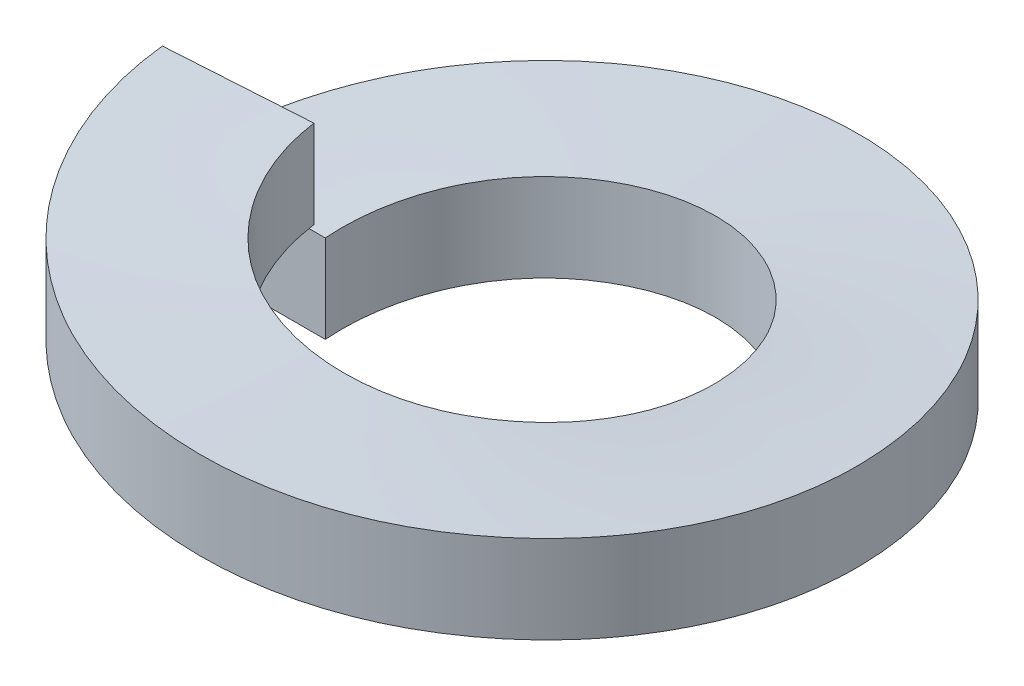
ISO-10303-21;
HEADER;
FILE_DESCRIPTION(('STEP AP214'),'2;1');
FILE_NAME('part.step','',(''),(''),'','','');
FILE_SCHEMA(('AUTOMOTIVE_DESIGN { 1 0 10303 214 1 1 1 1 }'));
ENDSEC;
DATA;
#1=APPLICATION_CONTEXT('core data for automotive mechanical design processes');
#2=APPLICATION_PROTOCOL_DEFINITION('international standard','automotive_design',2000,#1);
#3=PRODUCT_CONTEXT('',#1,'mechanical');
#4=PRODUCT('Part','Part','',(#3));
#5=PRODUCT_RELATED_PRODUCT_CATEGORY('part','',(#4));
#6=PRODUCT_DEFINITION_FORMATION('','',#4);
#7=PRODUCT_DEFINITION_CONTEXT('part definition',#1,'design');
#8=PRODUCT_DEFINITION('design','',#6,#7);
#9=PRODUCT_DEFINITION_SHAPE('','',#8);
#10=(LENGTH_UNIT() NAMED_UNIT(*) SI_UNIT(.MILLI.,.METRE.));
#11=(NAMED_UNIT(*) PLANE_ANGLE_UNIT() SI_UNIT($,.RADIAN.));
#12=(NAMED_UNIT(*) SI_UNIT($,.STERADIAN.) SOLID_ANGLE_UNIT());
#13=UNCERTAINTY_MEASURE_WITH_UNIT(LENGTH_MEASURE(1.E-05),#10,'distance_accuracy_value','');
#14=(GEOMETRIC_REPRESENTATION_CONTEXT(3) GLOBAL_UNCERTAINTY_ASSIGNED_CONTEXT((#13)) GLOBAL_UNIT_ASSIGNED_CONTEXT((#10,
#11,#12)) REPRESENTATION_CONTEXT('',''));
#15=CARTESIAN_POINT('',(0.,0.,0.));
#16=DIRECTION('',(0.,0.,1.));
#17=DIRECTION('',(1.,0.,0.));
#18=AXIS2_PLACEMENT_3D('',#15,#16,#17);
#19=CARTESIAN_POINT('',(-3.81,0.,0.));
#20=DIRECTION('',(0.,0.,1.));
#21=DIRECTION('',(1.,0.,0.));
#22=AXIS2_PLACEMENT_3D('',#19,#20,#21);
#23=PLANE('',#22);
#24=DIRECTION('',(0.,-1.,0.));
#25=VECTOR('',#24,1.);
#26=CARTESIAN_POINT('',(-3.81,1.016,0.));
#27=LINE('',#26,#25);
#28=CARTESIAN_POINT('',(-3.81,1.016,0.));
#29=VERTEX_POINT('',#28);
#30=CARTESIAN_POINT('',(-3.81,0.,0.));
#31=VERTEX_POINT('',#30);
#32=EDGE_CURVE('E87',#29,#31,#27,.T.);
#33=ORIENTED_EDGE('',*,*,#32,.T.);
#34=DIRECTION('',(1.,0.,0.));
#35=VECTOR('',#34,1.);
#36=CARTESIAN_POINT('',(-3.81,0.,0.));
#37=LINE('',#36,#35);
#38=CARTESIAN_POINT('',(-2.159,0.,0.));
#39=VERTEX_POINT('',#38);
#40=EDGE_CURVE('E80',#31,#39,#37,.T.);
#41=ORIENTED_EDGE('',*,*,#40,.T.);
#42=DIRECTION('',(0.,1.,0.));
#43=VECTOR('',#42,1.);
#44=CARTESIAN_POINT('',(-2.159,1.016,0.));
#45=LINE('',#44,#43);
#46=CARTESIAN_POINT('',(-2.159,1.016,0.));
#47=VERTEX_POINT('',#46);
#48=EDGE_CURVE('E75',#39,#47,#45,.T.);
#49=ORIENTED_EDGE('',*,*,#48,.T.);
#50=DIRECTION('',(-1.,0.,0.));
#51=VECTOR('',#50,1.);
#52=CARTESIAN_POINT('',(-3.81,1.016,0.));
#53=LINE('',#52,#51);
#54=EDGE_CURVE('E70',#47,#29,#53,.T.);
#55=ORIENTED_EDGE('',*,*,#54,.T.);
#56=EDGE_LOOP('',(#33,#41,#49,#55));
#57=FACE_BOUND('',#56,.T.);
#58=ADVANCED_FACE('F35',(#57),#23,.T.);
#59=CARTESIAN_POINT('',(-3.80248183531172,1.2192,0.239231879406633));
#60=DIRECTION('',(0.0627905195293,0.,0.998026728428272));
#61=DIRECTION('',(0.998026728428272,0.,-0.0627905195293));
#62=AXIS2_PLACEMENT_3D('',#59,#60,#61);
#63=PLANE('',#62);
#64=DIRECTION('',(0.,-1.,0.));
#65=VECTOR('',#64,1.);
#66=CARTESIAN_POINT('',(-3.80248183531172,2.2352,0.239231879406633));
#67=LINE('',#66,#65);
#68=CARTESIAN_POINT('',(-3.80248183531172,2.2352,0.239231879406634));
#69=VERTEX_POINT('',#68);
#70=CARTESIAN_POINT('',(-3.80248183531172,1.2192,0.239231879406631));
#71=VERTEX_POINT('',#70);
#72=EDGE_CURVE('E95',#69,#71,#67,.T.);
#73=ORIENTED_EDGE('',*,*,#72,.F.);
#74=DIRECTION('',(-0.998026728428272,0.,0.0627905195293));
#75=VECTOR('',#74,1.);
#76=CARTESIAN_POINT('',(-3.80248183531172,2.2352,0.239231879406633));
#77=LINE('',#76,#75);
#78=CARTESIAN_POINT('',(-2.15473970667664,2.2352,0.13556473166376));
#79=VERTEX_POINT('',#78);
#80=EDGE_CURVE('E11',#79,#69,#77,.T.);
#81=ORIENTED_EDGE('',*,*,#80,.F.);
#82=DIRECTION('',(0.,1.,0.));
#83=VECTOR('',#82,1.);
#84=CARTESIAN_POINT('',(-2.15473970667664,2.2352,0.135564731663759));
#85=LINE('',#84,#83);
#86=CARTESIAN_POINT('',(-2.15473970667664,1.2192,0.135564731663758));
#87=VERTEX_POINT('',#86);
#88=EDGE_CURVE('E49',#87,#79,#85,.T.);
#89=ORIENTED_EDGE('',*,*,#88,.F.);
#90=DIRECTION('',(0.998026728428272,0.,-0.0627905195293));
#91=VECTOR('',#90,1.);
#92=CARTESIAN_POINT('',(-3.80248183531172,1.2192,0.239231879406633));
#93=LINE('',#92,#91);
#94=EDGE_CURVE('E58',#71,#87,#93,.T.);
#95=ORIENTED_EDGE('',*,*,#94,.F.);
#96=EDGE_LOOP('',(#73,#81,#89,#95));
#97=FACE_BOUND('',#96,.T.);
#98=ADVANCED_FACE('F141',(#97),#63,.F.);
#99=CARTESIAN_POINT('',(0.,0.,0.));
#100=DIRECTION('',(0.,1.,0.));
#101=DIRECTION('',(0.,0.,1.));
#102=AXIS2_PLACEMENT_3D('',#99,#100,#101);
#103=CYLINDRICAL_SURFACE('',#102,3.81);
#104=CARTESIAN_POINT('',(-3.81,0.,0.));
#105=CARTESIAN_POINT('',(-3.81,0.1016,-2.17318563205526));
#106=CARTESIAN_POINT('',(-1.93944779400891,0.2032,-3.27942712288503));
#107=CARTESIAN_POINT('',(-0.0688955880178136,0.3048,-4.3856686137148));
#108=CARTESIAN_POINT('',(1.83548149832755,0.4064,-3.33872845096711));
#109=CARTESIAN_POINT('',(3.73985858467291,0.508,-2.29178828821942));
#110=CARTESIAN_POINT('',(3.80811999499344,0.6096,-0.119674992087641));
#111=CARTESIAN_POINT('',(3.87638140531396,0.7112,2.05243830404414));
#112=CARTESIAN_POINT('',(2.04150008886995,0.8128,3.2168893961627));
#113=CARTESIAN_POINT('',(0.206618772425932,0.9144,4.38134048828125));
#114=CARTESIAN_POINT('',(-1.72970380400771,1.016,3.39473485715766));
#115=CARTESIAN_POINT('',(-3.66602638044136,1.1176,2.40812922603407));
#116=CARTESIAN_POINT('',(-3.80248183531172,1.2192,0.239231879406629));
#117=(BOUNDED_CURVE() B_SPLINE_CURVE(2,(#104,#105,#106,#107,#108,#109,#110,#111,#112,#113,#114,
#115,#116),.UNSPECIFIED.,.F.,.F.) B_SPLINE_CURVE_WITH_KNOTS((3,2,2,2,2,2,3),(0.,
0.166666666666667,0.333333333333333,0.5,0.666666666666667,0.833333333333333,1.),
.UNSPECIFIED.) CURVE() GEOMETRIC_REPRESENTATION_ITEM() RATIONAL_B_SPLINE_CURVE((1.,
0.868631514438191,1.,0.868631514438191,1.,0.868631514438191,1.,0.868631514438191,1.,
0.868631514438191,1.,0.868631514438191,1.)) REPRESENTATION_ITEM(''));
#118=EDGE_CURVE('E90',#31,#71,#117,.T.);
#119=ORIENTED_EDGE('',*,*,#118,.F.);
#120=ORIENTED_EDGE('',*,*,#32,.F.);
#121=CARTESIAN_POINT('',(-3.81,1.016,0.));
#122=CARTESIAN_POINT('',(-3.81,1.1176,-2.17318563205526));
#123=CARTESIAN_POINT('',(-1.93944779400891,1.2192,-3.27942712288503));
#124=CARTESIAN_POINT('',(-0.0688955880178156,1.3208,-4.3856686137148));
#125=CARTESIAN_POINT('',(1.83548149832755,1.4224,-3.33872845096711));
#126=CARTESIAN_POINT('',(3.73985858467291,1.524,-2.29178828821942));
#127=CARTESIAN_POINT('',(3.80811999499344,1.6256,-0.119674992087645));
#128=CARTESIAN_POINT('',(3.87638140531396,1.7272,2.05243830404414));
#129=CARTESIAN_POINT('',(2.04150008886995,1.8288,3.21688939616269));
#130=CARTESIAN_POINT('',(0.206618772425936,1.9304,4.38134048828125));
#131=CARTESIAN_POINT('',(-1.72970380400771,2.032,3.39473485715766));
#132=CARTESIAN_POINT('',(-3.66602638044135,2.1336,2.40812922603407));
#133=CARTESIAN_POINT('',(-3.80248183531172,2.2352,0.239231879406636));
#134=(BOUNDED_CURVE() B_SPLINE_CURVE(2,(#121,#122,#123,#124,#125,#126,#127,#128,#129,#130,#131,
#132,#133),.UNSPECIFIED.,.F.,.F.) B_SPLINE_CURVE_WITH_KNOTS((3,2,2,2,2,2,3),(0.,
0.166666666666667,0.333333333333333,0.5,0.666666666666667,0.833333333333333,1.),
.UNSPECIFIED.) CURVE() GEOMETRIC_REPRESENTATION_ITEM() RATIONAL_B_SPLINE_CURVE((1.,
0.868631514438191,1.,0.868631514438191,1.,0.868631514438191,1.,0.868631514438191,1.,
0.868631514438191,1.,0.868631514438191,1.)) REPRESENTATION_ITEM(''));
#135=EDGE_CURVE('E89',#29,#69,#134,.T.);
#136=ORIENTED_EDGE('',*,*,#135,.T.);
#137=ORIENTED_EDGE('',*,*,#72,.T.);
#138=EDGE_LOOP('',(#119,#120,#136,#137));
#139=FACE_BOUND('',#138,.T.);
#140=ADVANCED_FACE('F88',(#139),#103,.T.);
#141=CARTESIAN_POINT('',(-3.81,0.,0.));
#142=CARTESIAN_POINT('',(-3.81,0.1016,-2.17318563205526));
#143=CARTESIAN_POINT('',(-1.93944779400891,0.2032,-3.27942712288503));
#144=CARTESIAN_POINT('',(-0.0688955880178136,0.3048,-4.3856686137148));
#145=CARTESIAN_POINT('',(1.83548149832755,0.4064,-3.33872845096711));
#146=CARTESIAN_POINT('',(3.73985858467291,0.508,-2.29178828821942));
#147=CARTESIAN_POINT('',(3.80811999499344,0.6096,-0.119674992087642));
#148=CARTESIAN_POINT('',(3.87638140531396,0.7112,2.05243830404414));
#149=CARTESIAN_POINT('',(2.04150008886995,0.8128,3.2168893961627));
#150=CARTESIAN_POINT('',(0.206618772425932,0.9144,4.38134048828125));
#151=CARTESIAN_POINT('',(-1.72970380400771,1.016,3.39473485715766));
#152=CARTESIAN_POINT('',(-3.66602638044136,1.1176,2.40812922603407));
#153=CARTESIAN_POINT('',(-3.80248183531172,1.2192,0.239231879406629));
#154=CARTESIAN_POINT('',(-2.159,0.,0.));
#155=CARTESIAN_POINT('',(-2.159,0.1016,-1.23147185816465));
#156=CARTESIAN_POINT('',(-1.09902041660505,0.2032,-1.85834203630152));
#157=CARTESIAN_POINT('',(-0.0390408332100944,0.3048,-2.48521221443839));
#158=CARTESIAN_POINT('',(1.04010618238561,0.4064,-1.8919461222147));
#159=CARTESIAN_POINT('',(2.11925319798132,0.508,-1.29868002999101));
#160=CARTESIAN_POINT('',(2.15793466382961,0.6096,-0.0678158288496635));
#161=CARTESIAN_POINT('',(2.19661612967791,0.7112,1.16304837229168));
#162=CARTESIAN_POINT('',(1.15685005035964,0.8128,1.82290399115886));
#163=CARTESIAN_POINT('',(0.117083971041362,0.9144,2.48275961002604));
#164=CARTESIAN_POINT('',(-0.980165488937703,1.016,1.92368308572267));
#165=CARTESIAN_POINT('',(-2.07741494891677,1.1176,1.36460656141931));
#166=CARTESIAN_POINT('',(-2.15473970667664,1.2192,0.135564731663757));
#167=(BOUNDED_SURFACE() B_SPLINE_SURFACE(1,2,((#141,#142,#143,#144,#145,#146,#147,#148,#149,
#150,#151,#152,#153),(#154,#155,#156,#157,#158,#159,#160,#161,#162,#163,#164,#165,#166)),
.UNSPECIFIED.,.F.,.F.,.F.) B_SPLINE_SURFACE_WITH_KNOTS((2,2),(3,2,2,2,2,2,3),(0.,1.),(0.,
0.166666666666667,0.333333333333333,0.5,0.666666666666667,0.833333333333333,1.),
.UNSPECIFIED.) GEOMETRIC_REPRESENTATION_ITEM() RATIONAL_B_SPLINE_SURFACE(((1.,0.868631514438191,
1.,0.868631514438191,1.,0.868631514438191,1.,0.868631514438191,1.,0.868631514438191,1.,
0.868631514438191,1.),(1.,0.868631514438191,1.,0.868631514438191,1.,0.868631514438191,1.,
0.868631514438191,1.,0.868631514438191,1.,0.868631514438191,1.))) REPRESENTATION_ITEM('') SURFACE());
#168=CARTESIAN_POINT('',(-2.159,0.,0.));
#169=CARTESIAN_POINT('',(-2.159,0.1016,-1.23147185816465));
#170=CARTESIAN_POINT('',(-1.09902041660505,0.2032,-1.85834203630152));
#171=CARTESIAN_POINT('',(-0.0390408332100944,0.3048,-2.48521221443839));
#172=CARTESIAN_POINT('',(1.04010618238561,0.4064,-1.8919461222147));
#173=CARTESIAN_POINT('',(2.11925319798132,0.508,-1.29868002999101));
#174=CARTESIAN_POINT('',(2.15793466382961,0.6096,-0.0678158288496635));
#175=CARTESIAN_POINT('',(2.19661612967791,0.7112,1.16304837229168));
#176=CARTESIAN_POINT('',(1.15685005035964,0.8128,1.82290399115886));
#177=CARTESIAN_POINT('',(0.117083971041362,0.9144,2.48275961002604));
#178=CARTESIAN_POINT('',(-0.980165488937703,1.016,1.92368308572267));
#179=CARTESIAN_POINT('',(-2.07741494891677,1.1176,1.36460656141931));
#180=CARTESIAN_POINT('',(-2.15473970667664,1.2192,0.135564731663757));
#181=(BOUNDED_CURVE() B_SPLINE_CURVE(2,(#168,#169,#170,#171,#172,#173,#174,#175,#176,#177,#178,
#179,#180),.UNSPECIFIED.,.F.,.F.) B_SPLINE_CURVE_WITH_KNOTS((3,2,2,2,2,2,3),(0.,
0.166666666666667,0.333333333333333,0.5,0.666666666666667,0.833333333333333,1.),
.UNSPECIFIED.) CURVE() GEOMETRIC_REPRESENTATION_ITEM() RATIONAL_B_SPLINE_CURVE((1.,
0.868631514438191,1.,0.868631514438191,1.,0.868631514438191,1.,0.868631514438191,1.,
0.868631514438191,1.,0.868631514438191,1.)) REPRESENTATION_ITEM(''));
#182=EDGE_CURVE('E110',#39,#87,#181,.T.);
#183=ORIENTED_EDGE('',*,*,#182,.F.);
#184=ORIENTED_EDGE('',*,*,#40,.F.);
#185=ORIENTED_EDGE('',*,*,#118,.T.);
#186=ORIENTED_EDGE('',*,*,#94,.T.);
#187=EDGE_LOOP('',(#183,#184,#185,#186));
#188=FACE_BOUND('',#187,.T.);
#189=ADVANCED_FACE('F128',(#188),#167,.F.);
#190=CARTESIAN_POINT('',(0.,0.,0.));
#191=DIRECTION('',(0.,1.,0.));
#192=DIRECTION('',(0.,0.,1.));
#193=AXIS2_PLACEMENT_3D('',#190,#191,#192);
#194=CYLINDRICAL_SURFACE('',#193,2.159);
#195=CARTESIAN_POINT('',(-2.159,1.016,0.));
#196=CARTESIAN_POINT('',(-2.159,1.1176,-1.23147185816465));
#197=CARTESIAN_POINT('',(-1.09902041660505,1.2192,-1.85834203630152));
#198=CARTESIAN_POINT('',(-0.0390408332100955,1.3208,-2.48521221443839));
#199=CARTESIAN_POINT('',(1.04010618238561,1.4224,-1.8919461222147));
#200=CARTESIAN_POINT('',(2.11925319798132,1.524,-1.29868002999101));
#201=CARTESIAN_POINT('',(2.15793466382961,1.6256,-0.0678158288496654));
#202=CARTESIAN_POINT('',(2.19661612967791,1.7272,1.16304837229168));
#203=CARTESIAN_POINT('',(1.15685005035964,1.8288,1.82290399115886));
#204=CARTESIAN_POINT('',(0.117083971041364,1.9304,2.48275961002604));
#205=CARTESIAN_POINT('',(-0.980165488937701,2.032,1.92368308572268));
#206=CARTESIAN_POINT('',(-2.07741494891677,2.1336,1.36460656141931));
#207=CARTESIAN_POINT('',(-2.15473970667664,2.2352,0.135564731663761));
#208=(BOUNDED_CURVE() B_SPLINE_CURVE(2,(#195,#196,#197,#198,#199,#200,#201,#202,#203,#204,#205,
#206,#207),.UNSPECIFIED.,.F.,.F.) B_SPLINE_CURVE_WITH_KNOTS((3,2,2,2,2,2,3),(0.,
0.166666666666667,0.333333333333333,0.5,0.666666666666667,0.833333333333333,1.),
.UNSPECIFIED.) CURVE() GEOMETRIC_REPRESENTATION_ITEM() RATIONAL_B_SPLINE_CURVE((1.,
0.868631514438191,1.,0.868631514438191,1.,0.868631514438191,1.,0.868631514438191,1.,
0.868631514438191,1.,0.868631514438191,1.)) REPRESENTATION_ITEM(''));
#209=EDGE_CURVE('E42',#47,#79,#208,.T.);
#210=ORIENTED_EDGE('',*,*,#209,.F.);
#211=ORIENTED_EDGE('',*,*,#48,.F.);
#212=ORIENTED_EDGE('',*,*,#182,.T.);
#213=ORIENTED_EDGE('',*,*,#88,.T.);
#214=EDGE_LOOP('',(#210,#211,#212,#213));
#215=FACE_BOUND('',#214,.T.);
#216=ADVANCED_FACE('F126',(#215),#194,.F.);
#217=CARTESIAN_POINT('',(-2.159,1.016,0.));
#218=CARTESIAN_POINT('',(-2.159,1.1176,-1.23147185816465));
#219=CARTESIAN_POINT('',(-1.09902041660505,1.2192,-1.85834203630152));
#220=CARTESIAN_POINT('',(-0.0390408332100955,1.3208,-2.48521221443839));
#221=CARTESIAN_POINT('',(1.04010618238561,1.4224,-1.8919461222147));
#222=CARTESIAN_POINT('',(2.11925319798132,1.524,-1.29868002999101));
#223=CARTESIAN_POINT('',(2.15793466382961,1.6256,-0.0678158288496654));
#224=CARTESIAN_POINT('',(2.19661612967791,1.7272,1.16304837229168));
#225=CARTESIAN_POINT('',(1.15685005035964,1.8288,1.82290399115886));
#226=CARTESIAN_POINT('',(0.117083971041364,1.9304,2.48275961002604));
#227=CARTESIAN_POINT('',(-0.980165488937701,2.032,1.92368308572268));
#228=CARTESIAN_POINT('',(-2.07741494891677,2.1336,1.36460656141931));
#229=CARTESIAN_POINT('',(-2.15473970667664,2.2352,0.135564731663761));
#230=CARTESIAN_POINT('',(-3.81,1.016,0.));
#231=CARTESIAN_POINT('',(-3.81,1.1176,-2.17318563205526));
#232=CARTESIAN_POINT('',(-1.93944779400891,1.2192,-3.27942712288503));
#233=CARTESIAN_POINT('',(-0.0688955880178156,1.3208,-4.3856686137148));
#234=CARTESIAN_POINT('',(1.83548149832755,1.4224,-3.33872845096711));
#235=CARTESIAN_POINT('',(3.73985858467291,1.524,-2.29178828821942));
#236=CARTESIAN_POINT('',(3.80811999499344,1.6256,-0.119674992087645));
#237=CARTESIAN_POINT('',(3.87638140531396,1.7272,2.05243830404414));
#238=CARTESIAN_POINT('',(2.04150008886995,1.8288,3.21688939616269));
#239=CARTESIAN_POINT('',(0.206618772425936,1.9304,4.38134048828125));
#240=CARTESIAN_POINT('',(-1.72970380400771,2.032,3.39473485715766));
#241=CARTESIAN_POINT('',(-3.66602638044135,2.1336,2.40812922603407));
#242=CARTESIAN_POINT('',(-3.80248183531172,2.2352,0.239231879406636));
#243=(BOUNDED_SURFACE() B_SPLINE_SURFACE(1,2,((#217,#218,#219,#220,#221,#222,#223,#224,#225,
#226,#227,#228,#229),(#230,#231,#232,#233,#234,#235,#236,#237,#238,#239,#240,#241,#242)),
.UNSPECIFIED.,.F.,.F.,.F.) B_SPLINE_SURFACE_WITH_KNOTS((2,2),(3,2,2,2,2,2,3),(0.,1.),(0.,
0.166666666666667,0.333333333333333,0.5,0.666666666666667,0.833333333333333,1.),
.UNSPECIFIED.) GEOMETRIC_REPRESENTATION_ITEM() RATIONAL_B_SPLINE_SURFACE(((1.,0.868631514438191,
1.,0.868631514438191,1.,0.868631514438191,1.,0.868631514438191,1.,0.868631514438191,1.,
0.868631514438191,1.),(1.,0.868631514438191,1.,0.868631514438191,1.,0.868631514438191,1.,
0.868631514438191,1.,0.868631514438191,1.,0.868631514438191,1.))) REPRESENTATION_ITEM('') SURFACE());
#244=ORIENTED_EDGE('',*,*,#80,.T.);
#245=ORIENTED_EDGE('',*,*,#135,.F.);
#246=ORIENTED_EDGE('',*,*,#54,.F.);
#247=ORIENTED_EDGE('',*,*,#209,.T.);
#248=EDGE_LOOP('',(#244,#245,#246,#247));
#249=FACE_BOUND('',#248,.T.);
#250=ADVANCED_FACE('F93',(#249),#243,.F.);
#251=CLOSED_SHELL('',(#58,#98,#140,#189,#216,#250));
#252=MANIFOLD_SOLID_BREP('B2',#251);
#253=ADVANCED_BREP_SHAPE_REPRESENTATION('',(#18,#252),#14);
#254=SHAPE_DEFINITION_REPRESENTATION(#9,#253);
ENDSEC;
END-ISO-10303-21;
